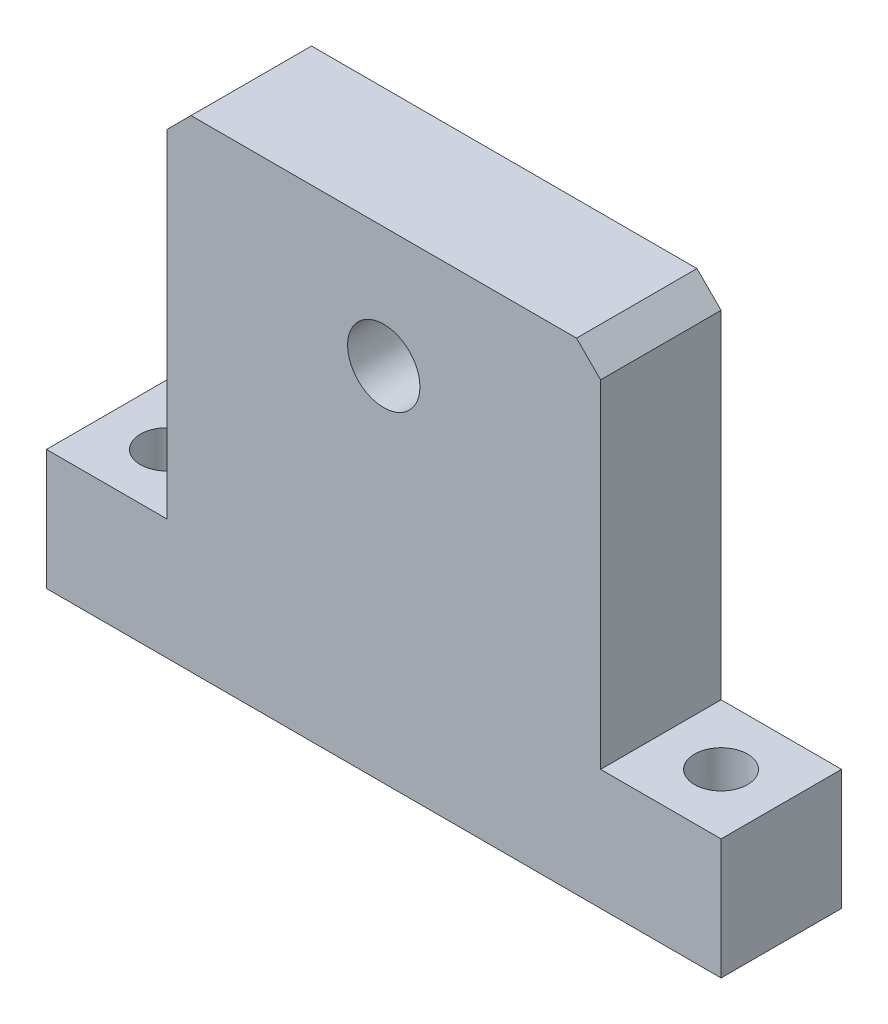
from build123d import *

# Parameters (mm, degrees)
SKETCH_3_W          = 140
SKETCH_3_H          = 100
EXTRUDE_1_DEPTH     = 12.5
SKETCH_4_R          = 7.5
CUT_EXTRUDE_1_DEPTH = 125.599357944
SKETCH_5_R          = 5.5
CUT_EXTRUDE_2_DEPTH = 123.703911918
SKETCH_6_W          = 25
SKETCH_6_H          = 75
CUT_EXTRUDE_3_DEPTH = 125.599357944
CHAMFER_1_SIZE      = 5


with BuildPart() as part:
    # Sketch 3 → Extrude 1 (new, symmetric)
    with BuildSketch(Plane.XY):
        with Locations((0, 50)):
            Rectangle(SKETCH_3_W, SKETCH_3_H)
    extrude(amount=EXTRUDE_1_DEPTH, both=True)

    # Sketch 4 → Cut-Extrude 1 (cut, through all)
    with BuildSketch(Plane.XY.offset(12.5)):
        with Locations((0, 75)):
            Circle(SKETCH_4_R)
    extrude(amount=-CUT_EXTRUDE_1_DEPTH, mode=Mode.SUBTRACT)

    # Sketch 5 → Cut-Extrude 2 (cut, through all)
    with BuildSketch(Plane(origin=(0, 100, 0), x_dir=(1, 0, 0), z_dir=(0, 1, 0))):
        with Locations(Location((57.5, 0, 0), (0, 0, 270))):
            Circle(SKETCH_5_R)
        with Locations(Location((-57.5, 0, 0), (0, 0, 270))):
            Circle(SKETCH_5_R)
    extrude(amount=-CUT_EXTRUDE_2_DEPTH, mode=Mode.SUBTRACT)

    # Sketch 6 → Cut-Extrude 3 (cut, through all)
    with BuildSketch(Plane.XY.offset(12.5)):
        with Locations((-57.5, 62.5)):
            Rectangle(SKETCH_6_W, SKETCH_6_H)
        with Locations((57.5, 62.5)):
            Rectangle(SKETCH_6_W, SKETCH_6_H)
    extrude(amount=-CUT_EXTRUDE_3_DEPTH, mode=Mode.SUBTRACT)

    # Chamfer 1
    chamfer_1_edges = [part.edges().sort_by_distance(p)[0] for p in [
        (-45, 100, 0),
        (45, 100, 0),
    ]]
    chamfer(chamfer_1_edges, length=CHAMFER_1_SIZE)


solid = part.part
